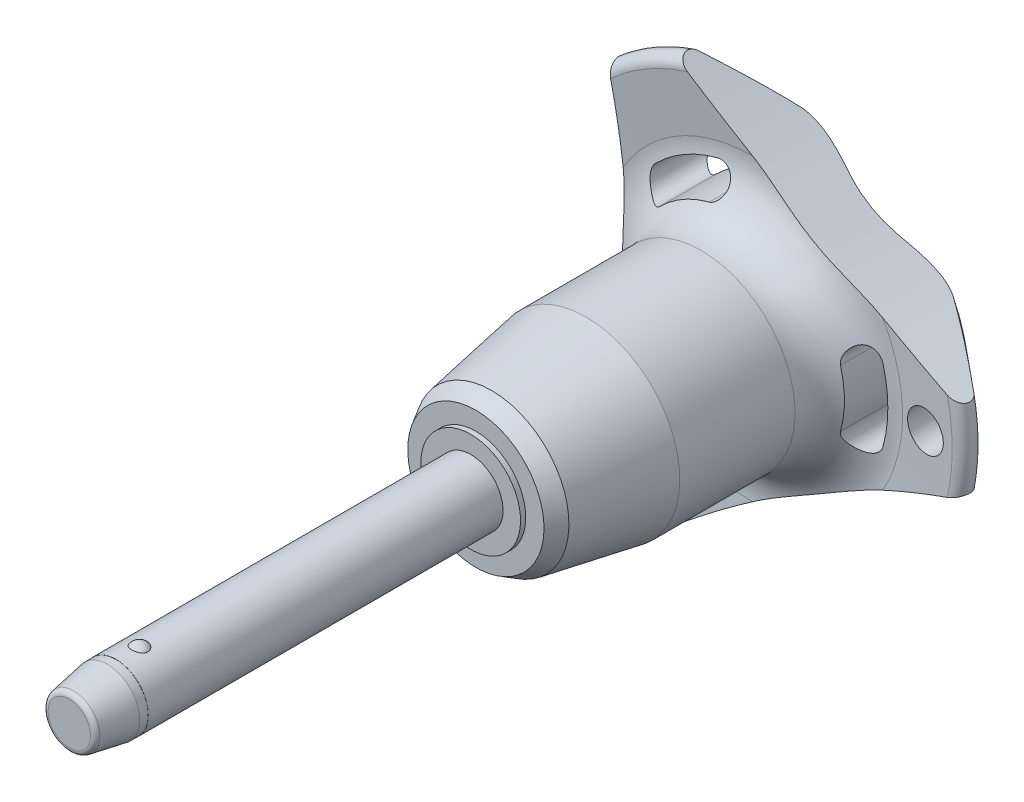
from build123d import *

# Parameters (mm, degrees)
SKETCH1_R           = 2.5
BOSS_EXTRUDE1_DEPTH = 25
SKETCH2_R           = 2.1
BOSS_EXTRUDE2_DEPTH = 26.7
BOSS_EXTRUDE3_START = 6
SKETCH1_2_R         = 2.5
BOSS_EXTRUDE3_DEPTH = 6
CHAMFER1_SIZE       = 3
CHAMFER1_SIZE2      = 0.528980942
FILLET1_R           = 0.4
SKETCH6_R           = 79.96
CUT_EXTRUDE1_DEPTH  = 57.781042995
CIRPATTERN1_COUNT   = 3
SKETCH7_R           = 1.5
CUT_EXTRUDE2_DEPTH  = 57.512343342
SKETCH8_R           = 2.5
SKETCH8_R_2         = 2.49
CUT_EXTRUDE3_DEPTH  = 3.6


with BuildPart() as part:
    # Sketch1 → Boss-Extrude1 (new body)
    with BuildSketch(Plane.XY):
        Circle(SKETCH1_R)
    extrude(amount=-BOSS_EXTRUDE1_DEPTH)

    # Sketch2 → Boss-Extrude2 (add)
    with BuildSketch(Plane(origin=(0, 0, -25), x_dir=(-1, 0, 0), z_dir=(0, 0, -1))):
        Circle(SKETCH2_R)
    extrude(amount=BOSS_EXTRUDE2_DEPTH)

    # Sketch3 → Revolve1 (revolve)
    with BuildSketch(Plane(origin=(0, 0, 0), x_dir=(0, 0, -1), z_dir=(1, 0, 0))):
        with BuildLine():
            Line((-0.580947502, 2.75), (-0.580947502, 1.15))
            ThreePointArc((-0.580947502, 1.15), (0.219052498, 1.95), (-0.580947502, 2.75))
        make_face()
        with BuildLine():
            Line((-0.580947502, -1.15), (-0.580947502, -2.75))
            ThreePointArc((-0.580947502, -2.75), (0.219052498, -1.95), (-0.580947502, -1.15))
        make_face()
    revolve(axis=Axis((0, -1.15, 0.580947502), (0, 1, 0)))

    # Sketch1_2 → Boss-Extrude3 (add)
    with BuildSketch(Plane.XY.offset(BOSS_EXTRUDE3_START)):
        Circle(SKETCH1_2_R)
    extrude(amount=-BOSS_EXTRUDE3_DEPTH)

    # Chamfer1
    chamfer1_edges = [part.edges().sort_by_distance(p)[0] for p in [
        (-2.5, 0, 6),
    ]]
    chamfer1_side = [part.faces().sort_by_distance(p)[0] for p in [
        (-2.5, 0, -9.5),
    ]]
    chamfer(chamfer1_edges, length=CHAMFER1_SIZE, length2=CHAMFER1_SIZE2, reference=chamfer1_side[0])

    # Fillet1
    fillet1_edges = [part.edges().sort_by_distance(p)[0] for p in [
        (-1.971019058, 0, 6),
        (2.1, 0, -51.7),
    ]]
    fillet(fillet1_edges, radius=FILLET1_R)

    # Sketch4 → Revolve2 (revolve)
    with BuildSketch(Plane(origin=(0, 0, 0), x_dir=(0, 0, -1), z_dir=(1, 0, 0))):
        Polygon((25, 0), (25, 3.851837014), (25.4, 3.851837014), (25.4, 5.26161122), (26.620900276, 5.966498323), (33.9, 7.25), (42.8, 7.25), (42.8, 0), align=None)
    revolve(axis=Axis((0, 0, -42.8), (0, 0, 1)))

    # Sketch5 → Revolve3 (revolve)
    with BuildSketch(Plane(origin=(0, 0, 0), x_dir=(0, 0, -1), z_dir=(1, 0, 0)), mode=Mode.PRIVATE) as revolve3_sk:
        with BuildLine():
            Line((46.78715932, 11.570250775), (46.452568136, 15.735949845))
            ThreePointArc((46.452568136, 15.735949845), (46.946485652, 16.540188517), (47.862835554, 16.314230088))
            Line((47.862835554, 16.314230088), (51.326414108, 12.186497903))
            ThreePointArc((51.326414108, 12.186497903), (51.7, 11.109282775), (51.261488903, 10.056825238))
            ThreePointArc((51.261488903, 10.056825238), (48.289873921, 5.413681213), (47.25, 0))
            Line((47.25, 0), (42.8, 0))
            Line((42.8, 0), (42.8, 7.25))
            ThreePointArc((42.8, 7.25), (45.739473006, 8.537160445), (46.78715932, 11.570250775))
        make_face()
    revolve(revolve3_sk.sketch.rotate(Axis((0, 0, -47.25), (0, 0, 1)), 90), axis=Axis((0, 0, -47.25), (0, 0, 1)))

    # Sketch6 → Cut-Extrude1 (cut, through all)
    with BuildSketch(Plane.XY):
        with Locations((-89.76, 0)):
            Circle(SKETCH6_R)
        with BuildLine():
            ThreePointArc((10.113209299, -2.786941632), (10.490188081, 0), (10.113209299, 2.786941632))
            ThreePointArc((10.113209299, 2.786941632), (8.785018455, 3.541249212), (8.030710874, 2.213058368))
            ThreePointArc((8.030710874, 2.213058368), (8.330062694, 0), (8.030710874, -2.213058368))
            ThreePointArc((8.030710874, -2.213058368), (8.785018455, -3.541249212), (10.113209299, -2.786941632))
        make_face()
    cut_extrude1 = extrude(amount=-CUT_EXTRUDE1_DEPTH, mode=Mode.SUBTRACT)

    # CirPattern1: Cut-Extrude1 ×3 about axis
    cirpattern1_axis = Axis((0, 0, 0), (0, 0, 1))
    for i in range(1, CIRPATTERN1_COUNT):
        add(cut_extrude1.rotate(cirpattern1_axis, i * 360 / CIRPATTERN1_COUNT), mode=Mode.SUBTRACT)

    # Sketch7 → Cut-Extrude2 (cut, through all)
    with BuildSketch(Plane.XY):
        with Locations(Location((13.490188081, 0, 0), (0, 0, 225.221865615))):
            Circle(SKETCH7_R)
    extrude(amount=-CUT_EXTRUDE2_DEPTH, mode=Mode.SUBTRACT)

    # Sketch8 → Cut-Extrude3 (cut)
    with BuildSketch(Plane.XY.offset(6)):
        Circle(SKETCH8_R)
        Circle(SKETCH8_R_2, mode=Mode.SUBTRACT)
    extrude(amount=-CUT_EXTRUDE3_DEPTH, mode=Mode.SUBTRACT)


solid = part.part
